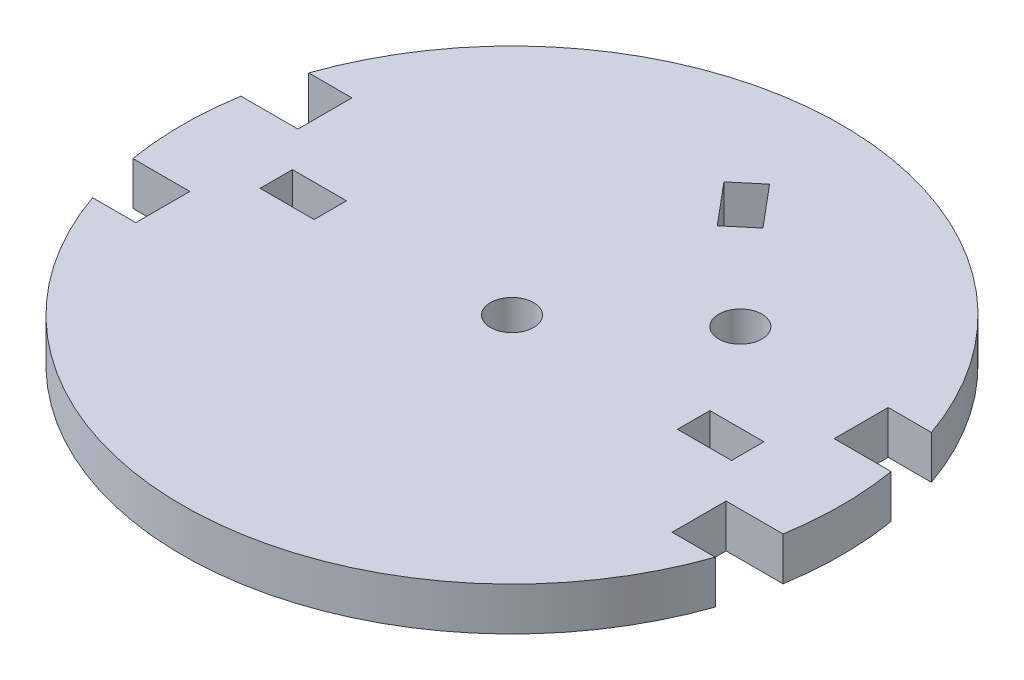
from build123d import *

# Parameters (mm, degrees)
CROQUIS1_R              = 30.5
SALIENTE_EXTRUIR1_DEPTH = 4
CROQUIS2_R              = 2
CORTAR_EXTRUIR1_DEPTH   = 4
CORTAR_EXTRUIR3_START   = -4
CORTAR_EXTRUIR3_DEPTH   = 4
CROQUIS6_W              = 5
CROQUIS6_H              = 3
CORTAR_EXTRUIR4_DEPTH   = 4
CROQUIS7_R              = 2
CORTAR_EXTRUIR5_DEPTH   = 4


with BuildPart() as part:
    # Croquis1 → Saliente-Extruir1 (new body)
    with BuildSketch(Plane(origin=(0, 0, 0), x_dir=(1, 0, 0), z_dir=(0, 1, 0))):
        with Locations(Location((0, 0, 0), (0, 0, 270))):
            Circle(CROQUIS1_R)
    extrude(amount=SALIENTE_EXTRUIR1_DEPTH)

    # Croquis2 → Cortar-Extruir1 (cut)
    with BuildSketch(Plane(origin=(0, 4, 0), x_dir=(1, 0, 0), z_dir=(0, 1, 0))):
        with Locations(Location((0, 0, 0), (0, 0, 270))):
            Circle(CROQUIS2_R)
    extrude(amount=-CORTAR_EXTRUIR1_DEPTH, mode=Mode.SUBTRACT)

    # Croquis5 → Cortar-Extruir3 (cut)
    with BuildSketch(Plane(origin=(0, 4, 0), x_dir=(1, 0, 0), z_dir=(0, 1, 0)).offset(CORTAR_EXTRUIR3_START)):
        with BuildLine():
            Line((28.814059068, 5), (30.087372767, 5))
            ThreePointArc((30.087372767, 5), (29.556634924, 7.526973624), (28.814059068, 10))
            Line((28.814059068, 10), (24.814059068, 10))
            Line((24.814059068, 10), (24.814059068, 5))
            Line((24.814059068, 5), (28.814059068, 5))
        make_face()
        with BuildLine():
            Line((30.087372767, -5), (28.814059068, -5))
            Line((28.814059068, -5), (24.814059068, -5))
            Line((24.814059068, -5), (24.814059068, -10))
            Line((24.814059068, -10), (28.814059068, -10))
            ThreePointArc((28.814059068, -10), (29.556634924, -7.526973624), (30.087372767, -5))
        make_face()
        with BuildLine():
            Line((-24.814059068, 5), (-24.814059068, 10))
            Line((-24.814059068, 10), (-28.814059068, 10))
            ThreePointArc((-28.814059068, 10), (-29.556634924, 7.526973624), (-30.087372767, 5))
            Line((-30.087372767, 5), (-28.814059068, 5))
            Line((-28.814059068, 5), (-24.814059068, 5))
        make_face()
        with BuildLine():
            Line((-28.814059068, -10), (-24.814059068, -10))
            Line((-24.814059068, -10), (-24.814059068, -5))
            Line((-24.814059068, -5), (-28.814059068, -5))
            Line((-28.814059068, -5), (-30.087372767, -5))
            ThreePointArc((-30.087372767, -5), (-29.556634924, -7.526973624), (-28.814059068, -10))
        make_face()
    extrude(amount=CORTAR_EXTRUIR3_DEPTH, mode=Mode.SUBTRACT)

    # Croquis6 → Cortar-Extruir4 (cut)
    with BuildSketch(Plane(origin=(0, 4, 0), x_dir=(1, 0, 0), z_dir=(0, 1, 0))):
        with Locations((-19.314059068, 0)):
            Rectangle(CROQUIS6_W, CROQUIS6_H)
        with Locations((19.314059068, 0)):
            Rectangle(CROQUIS6_W, CROQUIS6_H)
    extrude(amount=-CORTAR_EXTRUIR4_DEPTH, mode=Mode.SUBTRACT)

    # Croquis7 → Cortar-Extruir5 (cut)
    with BuildSketch(Plane(origin=(0, 4, 0), x_dir=(1, 0, 0), z_dir=(0, 1, 0))):
        with Locations(Location((11.490666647, 9.641814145, 0), (0, 0, 270))):
            Circle(CROQUIS7_R)
        Polygon((1.428390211, 22.411430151), (-0.869743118, 20.483067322), (2.34419493, 16.652845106), (4.642328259, 18.581207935), align=None)
    extrude(amount=-CORTAR_EXTRUIR5_DEPTH, mode=Mode.SUBTRACT)


solid = part.part
